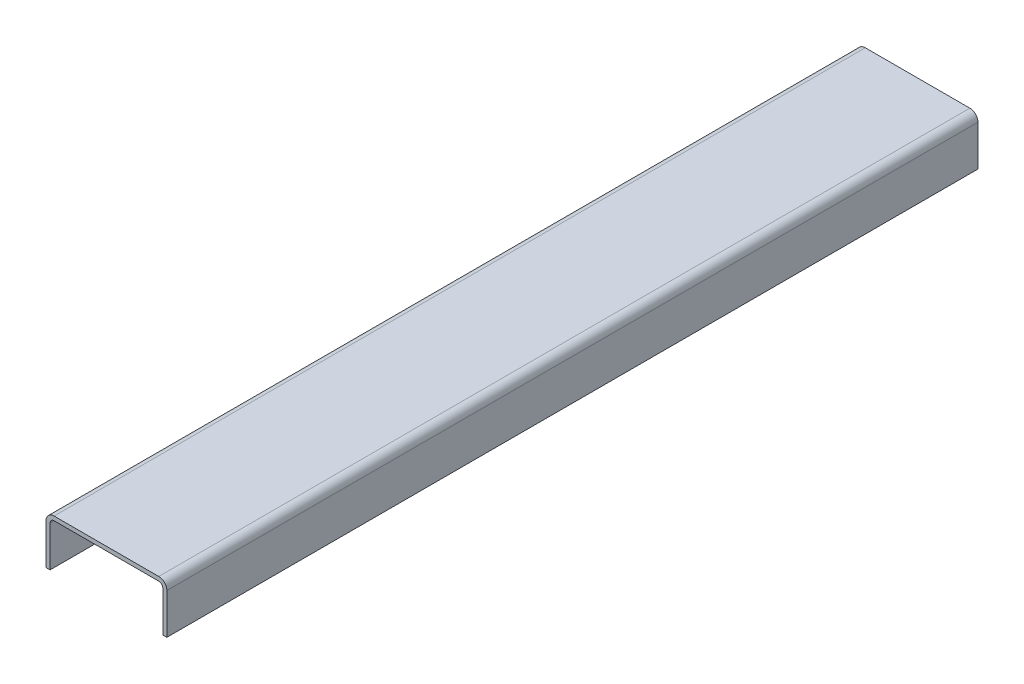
ISO-10303-21;
HEADER;
FILE_DESCRIPTION(('STEP AP214'),'2;1');
FILE_NAME('part.step','',(''),(''),'','','');
FILE_SCHEMA(('AUTOMOTIVE_DESIGN { 1 0 10303 214 1 1 1 1 }'));
ENDSEC;
DATA;
#1=APPLICATION_CONTEXT('core data for automotive mechanical design processes');
#2=APPLICATION_PROTOCOL_DEFINITION('international standard','automotive_design',2000,#1);
#3=PRODUCT_CONTEXT('',#1,'mechanical');
#4=PRODUCT('Part','Part','',(#3));
#5=PRODUCT_RELATED_PRODUCT_CATEGORY('part','',(#4));
#6=PRODUCT_DEFINITION_FORMATION('','',#4);
#7=PRODUCT_DEFINITION_CONTEXT('part definition',#1,'design');
#8=PRODUCT_DEFINITION('design','',#6,#7);
#9=PRODUCT_DEFINITION_SHAPE('','',#8);
#10=(LENGTH_UNIT() NAMED_UNIT(*) SI_UNIT(.MILLI.,.METRE.));
#11=(NAMED_UNIT(*) PLANE_ANGLE_UNIT() SI_UNIT($,.RADIAN.));
#12=(NAMED_UNIT(*) SI_UNIT($,.STERADIAN.) SOLID_ANGLE_UNIT());
#13=UNCERTAINTY_MEASURE_WITH_UNIT(LENGTH_MEASURE(1.E-05),#10,'distance_accuracy_value','');
#14=(GEOMETRIC_REPRESENTATION_CONTEXT(3) GLOBAL_UNCERTAINTY_ASSIGNED_CONTEXT((#13)) GLOBAL_UNIT_ASSIGNED_CONTEXT((#10,
#11,#12)) REPRESENTATION_CONTEXT('',''));
#15=CARTESIAN_POINT('',(0.,0.,0.));
#16=DIRECTION('',(0.,0.,1.));
#17=DIRECTION('',(1.,0.,0.));
#18=AXIS2_PLACEMENT_3D('',#15,#16,#17);
#19=CARTESIAN_POINT('',(0.,0.,1000.));
#20=DIRECTION('',(1.,0.,0.));
#21=DIRECTION('',(0.,0.,-1.));
#22=AXIS2_PLACEMENT_3D('',#19,#20,#21);
#23=PLANE('',#22);
#24=DIRECTION('',(0.,-1.,0.));
#25=VECTOR('',#24,1.);
#26=CARTESIAN_POINT('',(0.,0.,0.));
#27=LINE('',#26,#25);
#28=CARTESIAN_POINT('',(0.,49.9999999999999,0.));
#29=VERTEX_POINT('',#28);
#30=CARTESIAN_POINT('',(0.,0.,0.));
#31=VERTEX_POINT('',#30);
#32=EDGE_CURVE('E121',#29,#31,#27,.T.);
#33=ORIENTED_EDGE('',*,*,#32,.T.);
#34=DIRECTION('',(0.,0.,-1.));
#35=VECTOR('',#34,1.);
#36=CARTESIAN_POINT('',(0.,0.,1000.));
#37=LINE('',#36,#35);
#38=CARTESIAN_POINT('',(0.,0.,1000.));
#39=VERTEX_POINT('',#38);
#40=EDGE_CURVE('E11',#39,#31,#37,.T.);
#41=ORIENTED_EDGE('',*,*,#40,.F.);
#42=DIRECTION('',(0.,-1.,0.));
#43=VECTOR('',#42,1.);
#44=CARTESIAN_POINT('',(0.,0.,1000.));
#45=LINE('',#44,#43);
#46=CARTESIAN_POINT('',(0.,49.9999999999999,1000.));
#47=VERTEX_POINT('',#46);
#48=EDGE_CURVE('E156',#47,#39,#45,.T.);
#49=ORIENTED_EDGE('',*,*,#48,.F.);
#50=DIRECTION('',(0.,0.,-1.));
#51=VECTOR('',#50,1.);
#52=CARTESIAN_POINT('',(0.,49.9999999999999,1000.));
#53=LINE('',#52,#51);
#54=EDGE_CURVE('E134',#47,#29,#53,.T.);
#55=ORIENTED_EDGE('',*,*,#54,.T.);
#56=EDGE_LOOP('',(#33,#41,#49,#55));
#57=FACE_BOUND('',#56,.T.);
#58=ADVANCED_FACE('F29',(#57),#23,.F.);
#59=CARTESIAN_POINT('',(0.,0.,1000.));
#60=DIRECTION('',(0.,1.,0.));
#61=DIRECTION('',(0.,0.,1.));
#62=AXIS2_PLACEMENT_3D('',#59,#60,#61);
#63=PLANE('',#62);
#64=DIRECTION('',(1.,0.,0.));
#65=VECTOR('',#64,1.);
#66=CARTESIAN_POINT('',(0.,0.,0.));
#67=LINE('',#66,#65);
#68=CARTESIAN_POINT('',(5.,0.,0.));
#69=VERTEX_POINT('',#68);
#70=EDGE_CURVE('E117',#31,#69,#67,.T.);
#71=ORIENTED_EDGE('',*,*,#70,.T.);
#72=DIRECTION('',(0.,0.,-1.));
#73=VECTOR('',#72,1.);
#74=CARTESIAN_POINT('',(5.,0.,1000.));
#75=LINE('',#74,#73);
#76=CARTESIAN_POINT('',(5.,0.,1000.));
#77=VERTEX_POINT('',#76);
#78=EDGE_CURVE('E36',#77,#69,#75,.T.);
#79=ORIENTED_EDGE('',*,*,#78,.F.);
#80=DIRECTION('',(1.,0.,0.));
#81=VECTOR('',#80,1.);
#82=CARTESIAN_POINT('',(0.,0.,1000.));
#83=LINE('',#82,#81);
#84=EDGE_CURVE('E130',#39,#77,#83,.T.);
#85=ORIENTED_EDGE('',*,*,#84,.F.);
#86=ORIENTED_EDGE('',*,*,#40,.T.);
#87=EDGE_LOOP('',(#71,#79,#85,#86));
#88=FACE_BOUND('',#87,.T.);
#89=ADVANCED_FACE('F129',(#88),#63,.F.);
#90=CARTESIAN_POINT('',(5.,0.,1000.));
#91=DIRECTION('',(-1.,0.,0.));
#92=DIRECTION('',(0.,0.,1.));
#93=AXIS2_PLACEMENT_3D('',#90,#91,#92);
#94=PLANE('',#93);
#95=DIRECTION('',(0.,1.,0.));
#96=VECTOR('',#95,1.);
#97=CARTESIAN_POINT('',(5.,0.,0.));
#98=LINE('',#97,#96);
#99=CARTESIAN_POINT('',(5.,50.,0.));
#100=VERTEX_POINT('',#99);
#101=EDGE_CURVE('E123',#69,#100,#98,.T.);
#102=ORIENTED_EDGE('',*,*,#101,.T.);
#103=DIRECTION('',(0.,0.,-1.));
#104=VECTOR('',#103,1.);
#105=CARTESIAN_POINT('',(5.,50.,1000.));
#106=LINE('',#105,#104);
#107=CARTESIAN_POINT('',(5.,50.,1000.));
#108=VERTEX_POINT('',#107);
#109=EDGE_CURVE('E202',#108,#100,#106,.T.);
#110=ORIENTED_EDGE('',*,*,#109,.F.);
#111=DIRECTION('',(0.,1.,0.));
#112=VECTOR('',#111,1.);
#113=CARTESIAN_POINT('',(5.,0.,1000.));
#114=LINE('',#113,#112);
#115=EDGE_CURVE('E159',#77,#108,#114,.T.);
#116=ORIENTED_EDGE('',*,*,#115,.F.);
#117=ORIENTED_EDGE('',*,*,#78,.T.);
#118=EDGE_LOOP('',(#102,#110,#116,#117));
#119=FACE_BOUND('',#118,.T.);
#120=ADVANCED_FACE('F206',(#119),#94,.F.);
#121=CARTESIAN_POINT('',(10.,50.,1000.));
#122=DIRECTION('',(0.,0.,-1.));
#123=DIRECTION('',(-1.,0.,0.));
#124=AXIS2_PLACEMENT_3D('',#121,#122,#123);
#125=CYLINDRICAL_SURFACE('',#124,5.);
#126=CARTESIAN_POINT('',(10.,50.,0.));
#127=DIRECTION('',(0.,0.,-1.));
#128=DIRECTION('',(-1.,0.,0.));
#129=AXIS2_PLACEMENT_3D('',#126,#127,#128);
#130=CIRCLE('',#129,5.);
#131=CARTESIAN_POINT('',(10.,55.,0.));
#132=VERTEX_POINT('',#131);
#133=EDGE_CURVE('E138',#100,#132,#130,.T.);
#134=ORIENTED_EDGE('',*,*,#133,.T.);
#135=DIRECTION('',(0.,0.,-1.));
#136=VECTOR('',#135,1.);
#137=CARTESIAN_POINT('',(10.,55.,1000.));
#138=LINE('',#137,#136);
#139=CARTESIAN_POINT('',(10.,55.,1000.));
#140=VERTEX_POINT('',#139);
#141=EDGE_CURVE('E199',#140,#132,#138,.T.);
#142=ORIENTED_EDGE('',*,*,#141,.F.);
#143=CARTESIAN_POINT('',(10.,50.,1000.));
#144=DIRECTION('',(0.,0.,-1.));
#145=DIRECTION('',(-1.,0.,0.));
#146=AXIS2_PLACEMENT_3D('',#143,#144,#145);
#147=CIRCLE('',#146,5.);
#148=EDGE_CURVE('E161',#108,#140,#147,.T.);
#149=ORIENTED_EDGE('',*,*,#148,.F.);
#150=ORIENTED_EDGE('',*,*,#109,.T.);
#151=EDGE_LOOP('',(#134,#142,#149,#150));
#152=FACE_BOUND('',#151,.T.);
#153=ADVANCED_FACE('F214',(#152),#125,.F.);
#154=CARTESIAN_POINT('',(10.,55.,1000.));
#155=DIRECTION('',(0.,1.,0.));
#156=DIRECTION('',(0.,0.,1.));
#157=AXIS2_PLACEMENT_3D('',#154,#155,#156);
#158=PLANE('',#157);
#159=DIRECTION('',(1.,0.,0.));
#160=VECTOR('',#159,1.);
#161=CARTESIAN_POINT('',(10.,55.,0.));
#162=LINE('',#161,#160);
#163=CARTESIAN_POINT('',(139.,55.,0.));
#164=VERTEX_POINT('',#163);
#165=EDGE_CURVE('E140',#132,#164,#162,.T.);
#166=ORIENTED_EDGE('',*,*,#165,.T.);
#167=DIRECTION('',(0.,0.,-1.));
#168=VECTOR('',#167,1.);
#169=CARTESIAN_POINT('',(139.,55.,1000.));
#170=LINE('',#169,#168);
#171=CARTESIAN_POINT('',(139.,55.,1000.));
#172=VERTEX_POINT('',#171);
#173=EDGE_CURVE('E196',#172,#164,#170,.T.);
#174=ORIENTED_EDGE('',*,*,#173,.F.);
#175=DIRECTION('',(1.,0.,0.));
#176=VECTOR('',#175,1.);
#177=CARTESIAN_POINT('',(10.,55.,1000.));
#178=LINE('',#177,#176);
#179=EDGE_CURVE('E163',#140,#172,#178,.T.);
#180=ORIENTED_EDGE('',*,*,#179,.F.);
#181=ORIENTED_EDGE('',*,*,#141,.T.);
#182=EDGE_LOOP('',(#166,#174,#180,#181));
#183=FACE_BOUND('',#182,.T.);
#184=ADVANCED_FACE('F217',(#183),#158,.F.);
#185=CARTESIAN_POINT('',(139.,50.,1000.));
#186=DIRECTION('',(0.,0.,-1.));
#187=DIRECTION('',(-1.,0.,0.));
#188=AXIS2_PLACEMENT_3D('',#185,#186,#187);
#189=CYLINDRICAL_SURFACE('',#188,5.);
#190=CARTESIAN_POINT('',(139.,50.,0.));
#191=DIRECTION('',(0.,0.,-1.));
#192=DIRECTION('',(-1.,0.,0.));
#193=AXIS2_PLACEMENT_3D('',#190,#191,#192);
#194=CIRCLE('',#193,5.);
#195=CARTESIAN_POINT('',(144.,50.,0.));
#196=VERTEX_POINT('',#195);
#197=EDGE_CURVE('E142',#164,#196,#194,.T.);
#198=ORIENTED_EDGE('',*,*,#197,.T.);
#199=DIRECTION('',(0.,0.,-1.));
#200=VECTOR('',#199,1.);
#201=CARTESIAN_POINT('',(144.,50.,1000.));
#202=LINE('',#201,#200);
#203=CARTESIAN_POINT('',(144.,50.,1000.));
#204=VERTEX_POINT('',#203);
#205=EDGE_CURVE('E193',#204,#196,#202,.T.);
#206=ORIENTED_EDGE('',*,*,#205,.F.);
#207=CARTESIAN_POINT('',(139.,50.,1000.));
#208=DIRECTION('',(0.,0.,-1.));
#209=DIRECTION('',(-1.,0.,0.));
#210=AXIS2_PLACEMENT_3D('',#207,#208,#209);
#211=CIRCLE('',#210,5.);
#212=EDGE_CURVE('E165',#172,#204,#211,.T.);
#213=ORIENTED_EDGE('',*,*,#212,.F.);
#214=ORIENTED_EDGE('',*,*,#173,.T.);
#215=EDGE_LOOP('',(#198,#206,#213,#214));
#216=FACE_BOUND('',#215,.T.);
#217=ADVANCED_FACE('F222',(#216),#189,.F.);
#218=CARTESIAN_POINT('',(144.,0.,1000.));
#219=DIRECTION('',(1.,0.,0.));
#220=DIRECTION('',(0.,0.,-1.));
#221=AXIS2_PLACEMENT_3D('',#218,#219,#220);
#222=PLANE('',#221);
#223=DIRECTION('',(0.,-1.,0.));
#224=VECTOR('',#223,1.);
#225=CARTESIAN_POINT('',(144.,0.,0.));
#226=LINE('',#225,#224);
#227=CARTESIAN_POINT('',(144.,0.,0.));
#228=VERTEX_POINT('',#227);
#229=EDGE_CURVE('E144',#196,#228,#226,.T.);
#230=ORIENTED_EDGE('',*,*,#229,.T.);
#231=DIRECTION('',(0.,0.,-1.));
#232=VECTOR('',#231,1.);
#233=CARTESIAN_POINT('',(144.,0.,1000.));
#234=LINE('',#233,#232);
#235=CARTESIAN_POINT('',(144.,0.,1000.));
#236=VERTEX_POINT('',#235);
#237=EDGE_CURVE('E190',#236,#228,#234,.T.);
#238=ORIENTED_EDGE('',*,*,#237,.F.);
#239=DIRECTION('',(0.,-1.,0.));
#240=VECTOR('',#239,1.);
#241=CARTESIAN_POINT('',(144.,0.,1000.));
#242=LINE('',#241,#240);
#243=EDGE_CURVE('E167',#204,#236,#242,.T.);
#244=ORIENTED_EDGE('',*,*,#243,.F.);
#245=ORIENTED_EDGE('',*,*,#205,.T.);
#246=EDGE_LOOP('',(#230,#238,#244,#245));
#247=FACE_BOUND('',#246,.T.);
#248=ADVANCED_FACE('F228',(#247),#222,.F.);
#249=CARTESIAN_POINT('',(144.,0.,1000.));
#250=DIRECTION('',(0.,1.,0.));
#251=DIRECTION('',(0.,0.,1.));
#252=AXIS2_PLACEMENT_3D('',#249,#250,#251);
#253=PLANE('',#252);
#254=DIRECTION('',(1.,0.,0.));
#255=VECTOR('',#254,1.);
#256=CARTESIAN_POINT('',(144.,0.,0.));
#257=LINE('',#256,#255);
#258=CARTESIAN_POINT('',(149.,0.,0.));
#259=VERTEX_POINT('',#258);
#260=EDGE_CURVE('E146',#228,#259,#257,.T.);
#261=ORIENTED_EDGE('',*,*,#260,.T.);
#262=DIRECTION('',(0.,0.,-1.));
#263=VECTOR('',#262,1.);
#264=CARTESIAN_POINT('',(149.,0.,1000.));
#265=LINE('',#264,#263);
#266=CARTESIAN_POINT('',(149.,0.,1000.));
#267=VERTEX_POINT('',#266);
#268=EDGE_CURVE('E187',#267,#259,#265,.T.);
#269=ORIENTED_EDGE('',*,*,#268,.F.);
#270=DIRECTION('',(1.,0.,0.));
#271=VECTOR('',#270,1.);
#272=CARTESIAN_POINT('',(144.,0.,1000.));
#273=LINE('',#272,#271);
#274=EDGE_CURVE('E169',#236,#267,#273,.T.);
#275=ORIENTED_EDGE('',*,*,#274,.F.);
#276=ORIENTED_EDGE('',*,*,#237,.T.);
#277=EDGE_LOOP('',(#261,#269,#275,#276));
#278=FACE_BOUND('',#277,.T.);
#279=ADVANCED_FACE('F232',(#278),#253,.F.);
#280=CARTESIAN_POINT('',(149.,0.,1000.));
#281=DIRECTION('',(-1.,0.,0.));
#282=DIRECTION('',(0.,0.,1.));
#283=AXIS2_PLACEMENT_3D('',#280,#281,#282);
#284=PLANE('',#283);
#285=DIRECTION('',(0.,1.,0.));
#286=VECTOR('',#285,1.);
#287=CARTESIAN_POINT('',(149.,0.,0.));
#288=LINE('',#287,#286);
#289=CARTESIAN_POINT('',(149.,49.9999999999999,0.));
#290=VERTEX_POINT('',#289);
#291=EDGE_CURVE('E148',#259,#290,#288,.T.);
#292=ORIENTED_EDGE('',*,*,#291,.T.);
#293=DIRECTION('',(0.,0.,-1.));
#294=VECTOR('',#293,1.);
#295=CARTESIAN_POINT('',(149.,49.9999999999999,1000.));
#296=LINE('',#295,#294);
#297=CARTESIAN_POINT('',(149.,49.9999999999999,1000.));
#298=VERTEX_POINT('',#297);
#299=EDGE_CURVE('E184',#298,#290,#296,.T.);
#300=ORIENTED_EDGE('',*,*,#299,.F.);
#301=DIRECTION('',(0.,1.,0.));
#302=VECTOR('',#301,1.);
#303=CARTESIAN_POINT('',(149.,0.,1000.));
#304=LINE('',#303,#302);
#305=EDGE_CURVE('E171',#267,#298,#304,.T.);
#306=ORIENTED_EDGE('',*,*,#305,.F.);
#307=ORIENTED_EDGE('',*,*,#268,.T.);
#308=EDGE_LOOP('',(#292,#300,#306,#307));
#309=FACE_BOUND('',#308,.T.);
#310=ADVANCED_FACE('F237',(#309),#284,.F.);
#311=CARTESIAN_POINT('',(139.,50.,1000.));
#312=DIRECTION('',(0.,0.,-1.));
#313=DIRECTION('',(-1.,0.,0.));
#314=AXIS2_PLACEMENT_3D('',#311,#312,#313);
#315=CYLINDRICAL_SURFACE('',#314,10.);
#316=CARTESIAN_POINT('',(139.,50.,0.));
#317=DIRECTION('',(0.,0.,1.));
#318=DIRECTION('',(-1.,0.,0.));
#319=AXIS2_PLACEMENT_3D('',#316,#317,#318);
#320=CIRCLE('',#319,10.);
#321=CARTESIAN_POINT('',(139.,60.,0.));
#322=VERTEX_POINT('',#321);
#323=EDGE_CURVE('E150',#290,#322,#320,.T.);
#324=ORIENTED_EDGE('',*,*,#323,.T.);
#325=DIRECTION('',(0.,0.,-1.));
#326=VECTOR('',#325,1.);
#327=CARTESIAN_POINT('',(139.,60.,1000.));
#328=LINE('',#327,#326);
#329=CARTESIAN_POINT('',(139.,60.,1000.));
#330=VERTEX_POINT('',#329);
#331=EDGE_CURVE('E181',#330,#322,#328,.T.);
#332=ORIENTED_EDGE('',*,*,#331,.F.);
#333=CARTESIAN_POINT('',(139.,50.,1000.));
#334=DIRECTION('',(0.,0.,1.));
#335=DIRECTION('',(-1.,0.,0.));
#336=AXIS2_PLACEMENT_3D('',#333,#334,#335);
#337=CIRCLE('',#336,10.);
#338=EDGE_CURVE('E173',#298,#330,#337,.T.);
#339=ORIENTED_EDGE('',*,*,#338,.F.);
#340=ORIENTED_EDGE('',*,*,#299,.T.);
#341=EDGE_LOOP('',(#324,#332,#339,#340));
#342=FACE_BOUND('',#341,.T.);
#343=ADVANCED_FACE('F241',(#342),#315,.T.);
#344=CARTESIAN_POINT('',(10.0000000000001,60.,1000.));
#345=DIRECTION('',(0.,-1.,0.));
#346=DIRECTION('',(0.,0.,-1.));
#347=AXIS2_PLACEMENT_3D('',#344,#345,#346);
#348=PLANE('',#347);
#349=DIRECTION('',(-1.,0.,0.));
#350=VECTOR('',#349,1.);
#351=CARTESIAN_POINT('',(10.0000000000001,60.,0.));
#352=LINE('',#351,#350);
#353=CARTESIAN_POINT('',(10.0000000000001,60.,0.));
#354=VERTEX_POINT('',#353);
#355=EDGE_CURVE('E152',#322,#354,#352,.T.);
#356=ORIENTED_EDGE('',*,*,#355,.T.);
#357=DIRECTION('',(0.,0.,-1.));
#358=VECTOR('',#357,1.);
#359=CARTESIAN_POINT('',(10.0000000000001,60.,1000.));
#360=LINE('',#359,#358);
#361=CARTESIAN_POINT('',(10.0000000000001,60.,1000.));
#362=VERTEX_POINT('',#361);
#363=EDGE_CURVE('E178',#362,#354,#360,.T.);
#364=ORIENTED_EDGE('',*,*,#363,.F.);
#365=DIRECTION('',(-1.,0.,0.));
#366=VECTOR('',#365,1.);
#367=CARTESIAN_POINT('',(10.0000000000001,60.,1000.));
#368=LINE('',#367,#366);
#369=EDGE_CURVE('E48',#330,#362,#368,.T.);
#370=ORIENTED_EDGE('',*,*,#369,.F.);
#371=ORIENTED_EDGE('',*,*,#331,.T.);
#372=EDGE_LOOP('',(#356,#364,#370,#371));
#373=FACE_BOUND('',#372,.T.);
#374=ADVANCED_FACE('F245',(#373),#348,.F.);
#375=CARTESIAN_POINT('',(10.,50.,1000.));
#376=DIRECTION('',(0.,0.,-1.));
#377=DIRECTION('',(-1.,0.,0.));
#378=AXIS2_PLACEMENT_3D('',#375,#376,#377);
#379=CYLINDRICAL_SURFACE('',#378,10.);
#380=CARTESIAN_POINT('',(10.,50.,0.));
#381=DIRECTION('',(0.,0.,1.));
#382=DIRECTION('',(-1.,0.,0.));
#383=AXIS2_PLACEMENT_3D('',#380,#381,#382);
#384=CIRCLE('',#383,10.);
#385=EDGE_CURVE('E154',#354,#29,#384,.T.);
#386=ORIENTED_EDGE('',*,*,#385,.T.);
#387=ORIENTED_EDGE('',*,*,#54,.F.);
#388=CARTESIAN_POINT('',(10.,50.,1000.));
#389=DIRECTION('',(0.,0.,1.));
#390=DIRECTION('',(-1.,0.,0.));
#391=AXIS2_PLACEMENT_3D('',#388,#389,#390);
#392=CIRCLE('',#391,10.);
#393=EDGE_CURVE('E43',#362,#47,#392,.T.);
#394=ORIENTED_EDGE('',*,*,#393,.F.);
#395=ORIENTED_EDGE('',*,*,#363,.T.);
#396=EDGE_LOOP('',(#386,#387,#394,#395));
#397=FACE_BOUND('',#396,.T.);
#398=ADVANCED_FACE('F247',(#397),#379,.T.);
#399=CARTESIAN_POINT('',(10.,50.,1000.));
#400=DIRECTION('',(0.,0.,-1.));
#401=DIRECTION('',(-1.,0.,0.));
#402=AXIS2_PLACEMENT_3D('',#399,#400,#401);
#403=PLANE('',#402);
#404=ORIENTED_EDGE('',*,*,#48,.T.);
#405=ORIENTED_EDGE('',*,*,#84,.T.);
#406=ORIENTED_EDGE('',*,*,#115,.T.);
#407=ORIENTED_EDGE('',*,*,#148,.T.);
#408=ORIENTED_EDGE('',*,*,#179,.T.);
#409=ORIENTED_EDGE('',*,*,#212,.T.);
#410=ORIENTED_EDGE('',*,*,#243,.T.);
#411=ORIENTED_EDGE('',*,*,#274,.T.);
#412=ORIENTED_EDGE('',*,*,#305,.T.);
#413=ORIENTED_EDGE('',*,*,#338,.T.);
#414=ORIENTED_EDGE('',*,*,#369,.T.);
#415=ORIENTED_EDGE('',*,*,#393,.T.);
#416=EDGE_LOOP('',(#404,#405,#406,#407,#408,#409,#410,#411,#412,#413,#414,#415));
#417=FACE_BOUND('',#416,.T.);
#418=ADVANCED_FACE('F209',(#417),#403,.F.);
#419=CARTESIAN_POINT('',(10.,50.,0.));
#420=DIRECTION('',(0.,0.,-1.));
#421=DIRECTION('',(-1.,0.,0.));
#422=AXIS2_PLACEMENT_3D('',#419,#420,#421);
#423=PLANE('',#422);
#424=ORIENTED_EDGE('',*,*,#32,.F.);
#425=ORIENTED_EDGE('',*,*,#385,.F.);
#426=ORIENTED_EDGE('',*,*,#355,.F.);
#427=ORIENTED_EDGE('',*,*,#323,.F.);
#428=ORIENTED_EDGE('',*,*,#291,.F.);
#429=ORIENTED_EDGE('',*,*,#260,.F.);
#430=ORIENTED_EDGE('',*,*,#229,.F.);
#431=ORIENTED_EDGE('',*,*,#197,.F.);
#432=ORIENTED_EDGE('',*,*,#165,.F.);
#433=ORIENTED_EDGE('',*,*,#133,.F.);
#434=ORIENTED_EDGE('',*,*,#101,.F.);
#435=ORIENTED_EDGE('',*,*,#70,.F.);
#436=EDGE_LOOP('',(#424,#425,#426,#427,#428,#429,#430,#431,#432,#433,#434,#435));
#437=FACE_BOUND('',#436,.T.);
#438=ADVANCED_FACE('F118',(#437),#423,.T.);
#439=CLOSED_SHELL('',(#58,#89,#120,#153,#184,#217,#248,#279,#310,#343,#374,#398,#418,#438));
#440=MANIFOLD_SOLID_BREP('B2',#439);
#441=ADVANCED_BREP_SHAPE_REPRESENTATION('',(#18,#440),#14);
#442=SHAPE_DEFINITION_REPRESENTATION(#9,#441);
ENDSEC;
END-ISO-10303-21;
